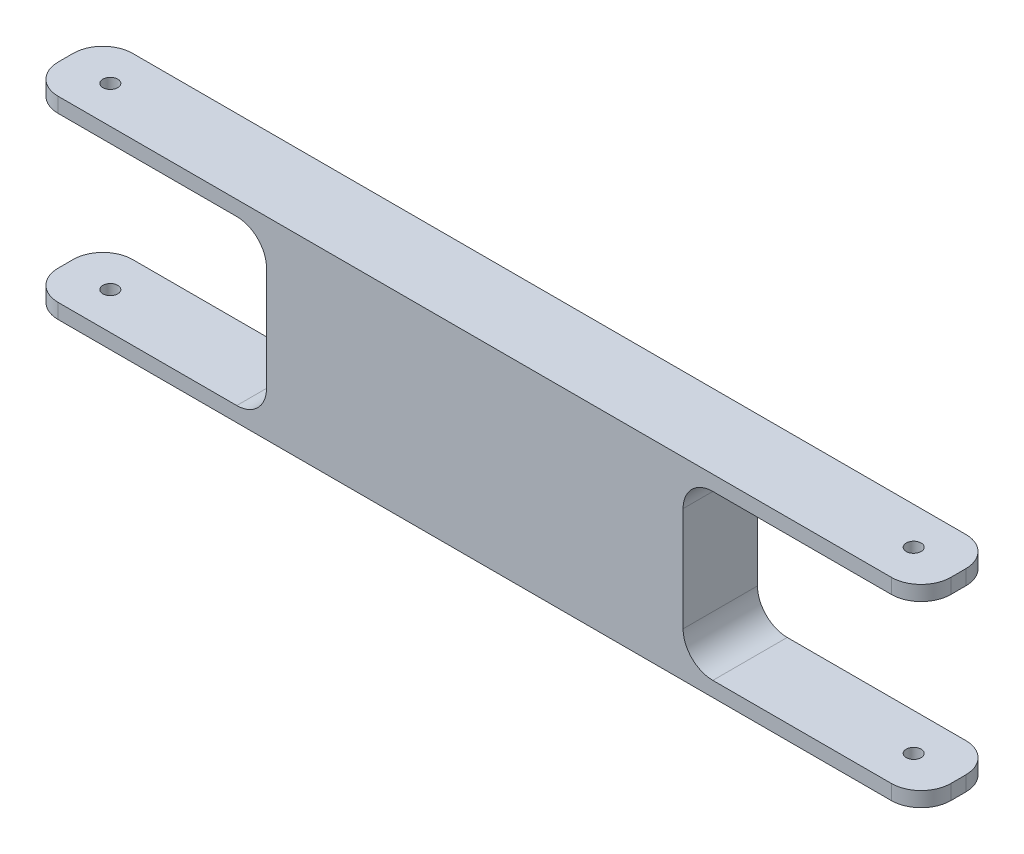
ISO-10303-21;
HEADER;
FILE_DESCRIPTION(('STEP AP214'),'2;1');
FILE_NAME('part.step','',(''),(''),'','','');
FILE_SCHEMA(('AUTOMOTIVE_DESIGN { 1 0 10303 214 1 1 1 1 }'));
ENDSEC;
DATA;
#1=APPLICATION_CONTEXT('core data for automotive mechanical design processes');
#2=APPLICATION_PROTOCOL_DEFINITION('international standard','automotive_design',2000,#1);
#3=PRODUCT_CONTEXT('',#1,'mechanical');
#4=PRODUCT('Part','Part','',(#3));
#5=PRODUCT_RELATED_PRODUCT_CATEGORY('part','',(#4));
#6=PRODUCT_DEFINITION_FORMATION('','',#4);
#7=PRODUCT_DEFINITION_CONTEXT('part definition',#1,'design');
#8=PRODUCT_DEFINITION('design','',#6,#7);
#9=PRODUCT_DEFINITION_SHAPE('','',#8);
#10=(LENGTH_UNIT() NAMED_UNIT(*) SI_UNIT(.MILLI.,.METRE.));
#11=(NAMED_UNIT(*) PLANE_ANGLE_UNIT() SI_UNIT($,.RADIAN.));
#12=(NAMED_UNIT(*) SI_UNIT($,.STERADIAN.) SOLID_ANGLE_UNIT());
#13=UNCERTAINTY_MEASURE_WITH_UNIT(LENGTH_MEASURE(1.E-05),#10,'distance_accuracy_value','');
#14=(GEOMETRIC_REPRESENTATION_CONTEXT(3) GLOBAL_UNCERTAINTY_ASSIGNED_CONTEXT((#13)) GLOBAL_UNIT_ASSIGNED_CONTEXT((#10,
#11,#12)) REPRESENTATION_CONTEXT('',''));
#15=CARTESIAN_POINT('',(0.,0.,0.));
#16=DIRECTION('',(0.,0.,1.));
#17=DIRECTION('',(1.,0.,0.));
#18=AXIS2_PLACEMENT_3D('',#15,#16,#17);
#19=CARTESIAN_POINT('',(-150.,-32.5,25.));
#20=DIRECTION('',(1.,0.,0.));
#21=DIRECTION('',(0.,0.,-1.));
#22=AXIS2_PLACEMENT_3D('',#19,#20,#21);
#23=PLANE('',#22);
#24=DIRECTION('',(0.,0.,1.));
#25=VECTOR('',#24,1.);
#26=CARTESIAN_POINT('',(-150.,27.5,-5.));
#27=LINE('',#26,#25);
#28=CARTESIAN_POINT('',(-150.,27.5,10.));
#29=VERTEX_POINT('',#28);
#30=CARTESIAN_POINT('',(-150.,27.5,15.));
#31=VERTEX_POINT('',#30);
#32=EDGE_CURVE('E249',#29,#31,#27,.T.);
#33=ORIENTED_EDGE('',*,*,#32,.T.);
#34=DIRECTION('',(0.,-1.,0.));
#35=VECTOR('',#34,1.);
#36=CARTESIAN_POINT('',(-150.,32.5,15.));
#37=LINE('',#36,#35);
#38=CARTESIAN_POINT('',(-150.,32.5,15.));
#39=VERTEX_POINT('',#38);
#40=EDGE_CURVE('E386',#31,#39,#37,.F.);
#41=ORIENTED_EDGE('',*,*,#40,.T.);
#42=DIRECTION('',(0.,0.,-1.));
#43=VECTOR('',#42,1.);
#44=CARTESIAN_POINT('',(-150.,32.5,25.));
#45=LINE('',#44,#43);
#46=CARTESIAN_POINT('',(-150.,32.5,10.));
#47=VERTEX_POINT('',#46);
#48=EDGE_CURVE('E266',#39,#47,#45,.T.);
#49=ORIENTED_EDGE('',*,*,#48,.T.);
#50=DIRECTION('',(0.,-1.,0.));
#51=VECTOR('',#50,1.);
#52=CARTESIAN_POINT('',(-150.,-32.5,10.));
#53=LINE('',#52,#51);
#54=EDGE_CURVE('E383',#47,#29,#53,.T.);
#55=ORIENTED_EDGE('',*,*,#54,.T.);
#56=EDGE_LOOP('',(#33,#41,#49,#55));
#57=FACE_BOUND('',#56,.T.);
#58=ADVANCED_FACE('F41',(#57),#23,.F.);
#59=CARTESIAN_POINT('',(150.,-32.5,25.));
#60=DIRECTION('',(-1.,0.,0.));
#61=DIRECTION('',(0.,0.,1.));
#62=AXIS2_PLACEMENT_3D('',#59,#60,#61);
#63=PLANE('',#62);
#64=DIRECTION('',(0.,0.,-1.));
#65=VECTOR('',#64,1.);
#66=CARTESIAN_POINT('',(150.,-32.5,25.));
#67=LINE('',#66,#65);
#68=CARTESIAN_POINT('',(150.,-32.5,15.));
#69=VERTEX_POINT('',#68);
#70=CARTESIAN_POINT('',(150.,-32.5,10.));
#71=VERTEX_POINT('',#70);
#72=EDGE_CURVE('E276',#69,#71,#67,.T.);
#73=ORIENTED_EDGE('',*,*,#72,.T.);
#74=DIRECTION('',(0.,1.,0.));
#75=VECTOR('',#74,1.);
#76=CARTESIAN_POINT('',(150.,-32.5,10.));
#77=LINE('',#76,#75);
#78=CARTESIAN_POINT('',(150.,-27.5,10.));
#79=VERTEX_POINT('',#78);
#80=EDGE_CURVE('E364',#71,#79,#77,.T.);
#81=ORIENTED_EDGE('',*,*,#80,.T.);
#82=DIRECTION('',(0.,0.,1.));
#83=VECTOR('',#82,1.);
#84=CARTESIAN_POINT('',(150.,-27.5,-5.));
#85=LINE('',#84,#83);
#86=CARTESIAN_POINT('',(150.,-27.5,15.));
#87=VERTEX_POINT('',#86);
#88=EDGE_CURVE('E237',#79,#87,#85,.T.);
#89=ORIENTED_EDGE('',*,*,#88,.T.);
#90=DIRECTION('',(0.,1.,0.));
#91=VECTOR('',#90,1.);
#92=CARTESIAN_POINT('',(150.,-32.5,15.));
#93=LINE('',#92,#91);
#94=EDGE_CURVE('E362',#87,#69,#93,.F.);
#95=ORIENTED_EDGE('',*,*,#94,.T.);
#96=EDGE_LOOP('',(#73,#81,#89,#95));
#97=FACE_BOUND('',#96,.T.);
#98=ADVANCED_FACE('F444',(#97),#63,.F.);
#99=DIRECTION('',(0.,0.,1.));
#100=VECTOR('',#99,1.);
#101=CARTESIAN_POINT('',(-150.,-27.5,-5.));
#102=LINE('',#101,#100);
#103=CARTESIAN_POINT('',(-150.,-27.5,10.));
#104=VERTEX_POINT('',#103);
#105=CARTESIAN_POINT('',(-150.,-27.5,15.));
#106=VERTEX_POINT('',#105);
#107=EDGE_CURVE('E246',#104,#106,#102,.T.);
#108=ORIENTED_EDGE('',*,*,#107,.F.);
#109=DIRECTION('',(0.,-1.,0.));
#110=VECTOR('',#109,1.);
#111=CARTESIAN_POINT('',(-150.,-32.5,10.));
#112=LINE('',#111,#110);
#113=CARTESIAN_POINT('',(-150.,-32.5,10.));
#114=VERTEX_POINT('',#113);
#115=EDGE_CURVE('E389',#104,#114,#112,.T.);
#116=ORIENTED_EDGE('',*,*,#115,.T.);
#117=DIRECTION('',(0.,0.,-1.));
#118=VECTOR('',#117,1.);
#119=CARTESIAN_POINT('',(-150.,-32.5,25.));
#120=LINE('',#119,#118);
#121=CARTESIAN_POINT('',(-150.,-32.5,15.));
#122=VERTEX_POINT('',#121);
#123=EDGE_CURVE('E279',#122,#114,#120,.T.);
#124=ORIENTED_EDGE('',*,*,#123,.F.);
#125=DIRECTION('',(0.,-1.,0.));
#126=VECTOR('',#125,1.);
#127=CARTESIAN_POINT('',(-150.,-27.5,15.));
#128=LINE('',#127,#126);
#129=EDGE_CURVE('E58',#122,#106,#128,.F.);
#130=ORIENTED_EDGE('',*,*,#129,.T.);
#131=EDGE_LOOP('',(#108,#116,#124,#130));
#132=FACE_BOUND('',#131,.T.);
#133=ADVANCED_FACE('F447',(#132),#23,.F.);
#134=CARTESIAN_POINT('',(150.,-32.5,25.));
#135=DIRECTION('',(0.,1.,0.));
#136=DIRECTION('',(-1.,0.,0.));
#137=AXIS2_PLACEMENT_3D('',#134,#135,#136);
#138=PLANE('',#137);
#139=CARTESIAN_POINT('',(135.,-32.5,12.5));
#140=DIRECTION('',(0.,-1.,0.));
#141=DIRECTION('',(1.,0.,0.));
#142=AXIS2_PLACEMENT_3D('',#139,#140,#141);
#143=CIRCLE('',#142,2.5);
#144=CARTESIAN_POINT('',(137.5,-32.5,12.5));
#145=VERTEX_POINT('',#144);
#146=EDGE_CURVE('E401',#145,#145,#143,.T.);
#147=ORIENTED_EDGE('',*,*,#146,.F.);
#148=EDGE_LOOP('',(#147));
#149=FACE_BOUND('',#148,.T.);
#150=CARTESIAN_POINT('',(-135.,-32.5,12.5));
#151=DIRECTION('',(0.,-1.,0.));
#152=DIRECTION('',(-1.,0.,0.));
#153=AXIS2_PLACEMENT_3D('',#150,#151,#152);
#154=CIRCLE('',#153,2.5);
#155=CARTESIAN_POINT('',(-137.5,-32.5,12.5));
#156=VERTEX_POINT('',#155);
#157=EDGE_CURVE('E406',#156,#156,#154,.T.);
#158=ORIENTED_EDGE('',*,*,#157,.F.);
#159=EDGE_LOOP('',(#158));
#160=FACE_BOUND('',#159,.T.);
#161=DIRECTION('',(1.,0.,0.));
#162=VECTOR('',#161,1.);
#163=CARTESIAN_POINT('',(150.,-32.5,0.));
#164=LINE('',#163,#162);
#165=CARTESIAN_POINT('',(-140.,-32.5,0.));
#166=VERTEX_POINT('',#165);
#167=CARTESIAN_POINT('',(140.,-32.5,0.));
#168=VERTEX_POINT('',#167);
#169=EDGE_CURVE('E244',#166,#168,#164,.T.);
#170=ORIENTED_EDGE('',*,*,#169,.T.);
#171=CARTESIAN_POINT('',(140.,-32.5,10.));
#172=DIRECTION('',(0.,1.,0.));
#173=DIRECTION('',(-1.,0.,0.));
#174=AXIS2_PLACEMENT_3D('',#171,#172,#173);
#175=CIRCLE('',#174,10.);
#176=EDGE_CURVE('E377',#168,#71,#175,.F.);
#177=ORIENTED_EDGE('',*,*,#176,.T.);
#178=ORIENTED_EDGE('',*,*,#72,.F.);
#179=CARTESIAN_POINT('',(140.,-32.5,15.));
#180=DIRECTION('',(0.,1.,0.));
#181=DIRECTION('',(-1.,0.,0.));
#182=AXIS2_PLACEMENT_3D('',#179,#180,#181);
#183=CIRCLE('',#182,10.);
#184=CARTESIAN_POINT('',(140.,-32.5,25.));
#185=VERTEX_POINT('',#184);
#186=EDGE_CURVE('E375',#69,#185,#183,.F.);
#187=ORIENTED_EDGE('',*,*,#186,.T.);
#188=DIRECTION('',(1.,0.,0.));
#189=VECTOR('',#188,1.);
#190=CARTESIAN_POINT('',(150.,-32.5,25.));
#191=LINE('',#190,#189);
#192=CARTESIAN_POINT('',(-140.,-32.5,25.));
#193=VERTEX_POINT('',#192);
#194=EDGE_CURVE('E260',#193,#185,#191,.T.);
#195=ORIENTED_EDGE('',*,*,#194,.F.);
#196=CARTESIAN_POINT('',(-140.,-32.5,15.));
#197=DIRECTION('',(0.,1.,0.));
#198=DIRECTION('',(-1.,0.,0.));
#199=AXIS2_PLACEMENT_3D('',#196,#197,#198);
#200=CIRCLE('',#199,10.);
#201=EDGE_CURVE('E371',#193,#122,#200,.F.);
#202=ORIENTED_EDGE('',*,*,#201,.T.);
#203=ORIENTED_EDGE('',*,*,#123,.T.);
#204=CARTESIAN_POINT('',(-140.,-32.5,10.));
#205=DIRECTION('',(0.,1.,0.));
#206=DIRECTION('',(-1.,0.,0.));
#207=AXIS2_PLACEMENT_3D('',#204,#205,#206);
#208=CIRCLE('',#207,10.);
#209=EDGE_CURVE('E373',#114,#166,#208,.F.);
#210=ORIENTED_EDGE('',*,*,#209,.T.);
#211=EDGE_LOOP('',(#170,#177,#178,#187,#195,#202,#203,#210));
#212=FACE_BOUND('',#211,.T.);
#213=ADVANCED_FACE('F458',(#149,#160,#212),#138,.F.);
#214=DIRECTION('',(0.,0.,1.));
#215=VECTOR('',#214,1.);
#216=CARTESIAN_POINT('',(150.,27.5,-5.));
#217=LINE('',#216,#215);
#218=CARTESIAN_POINT('',(150.,27.5,10.));
#219=VERTEX_POINT('',#218);
#220=CARTESIAN_POINT('',(150.,27.5,15.));
#221=VERTEX_POINT('',#220);
#222=EDGE_CURVE('E233',#219,#221,#217,.T.);
#223=ORIENTED_EDGE('',*,*,#222,.F.);
#224=DIRECTION('',(0.,1.,0.));
#225=VECTOR('',#224,1.);
#226=CARTESIAN_POINT('',(150.,-32.5,10.));
#227=LINE('',#226,#225);
#228=CARTESIAN_POINT('',(150.,32.5,10.));
#229=VERTEX_POINT('',#228);
#230=EDGE_CURVE('E329',#219,#229,#227,.T.);
#231=ORIENTED_EDGE('',*,*,#230,.T.);
#232=DIRECTION('',(0.,0.,-1.));
#233=VECTOR('',#232,1.);
#234=CARTESIAN_POINT('',(150.,32.5,25.));
#235=LINE('',#234,#233);
#236=CARTESIAN_POINT('',(150.,32.5,15.));
#237=VERTEX_POINT('',#236);
#238=EDGE_CURVE('E273',#237,#229,#235,.T.);
#239=ORIENTED_EDGE('',*,*,#238,.F.);
#240=DIRECTION('',(0.,1.,0.));
#241=VECTOR('',#240,1.);
#242=CARTESIAN_POINT('',(150.,27.5,15.));
#243=LINE('',#242,#241);
#244=EDGE_CURVE('E327',#237,#221,#243,.F.);
#245=ORIENTED_EDGE('',*,*,#244,.T.);
#246=EDGE_LOOP('',(#223,#231,#239,#245));
#247=FACE_BOUND('',#246,.T.);
#248=ADVANCED_FACE('F454',(#247),#63,.F.);
#249=CARTESIAN_POINT('',(150.,32.5,25.));
#250=DIRECTION('',(0.,-1.,0.));
#251=DIRECTION('',(1.,0.,0.));
#252=AXIS2_PLACEMENT_3D('',#249,#250,#251);
#253=PLANE('',#252);
#254=CARTESIAN_POINT('',(135.,32.5,12.5));
#255=DIRECTION('',(0.,-1.,0.));
#256=DIRECTION('',(1.,0.,0.));
#257=AXIS2_PLACEMENT_3D('',#254,#255,#256);
#258=CIRCLE('',#257,2.5);
#259=CARTESIAN_POINT('',(137.5,32.5,12.5));
#260=VERTEX_POINT('',#259);
#261=EDGE_CURVE('E395',#260,#260,#258,.T.);
#262=ORIENTED_EDGE('',*,*,#261,.T.);
#263=EDGE_LOOP('',(#262));
#264=FACE_BOUND('',#263,.T.);
#265=CARTESIAN_POINT('',(-135.,32.5,12.5));
#266=DIRECTION('',(0.,-1.,0.));
#267=DIRECTION('',(-1.,0.,0.));
#268=AXIS2_PLACEMENT_3D('',#265,#266,#267);
#269=CIRCLE('',#268,2.5);
#270=CARTESIAN_POINT('',(-137.5,32.5,12.5));
#271=VERTEX_POINT('',#270);
#272=EDGE_CURVE('E411',#271,#271,#269,.T.);
#273=ORIENTED_EDGE('',*,*,#272,.T.);
#274=EDGE_LOOP('',(#273));
#275=FACE_BOUND('',#274,.T.);
#276=ORIENTED_EDGE('',*,*,#238,.T.);
#277=CARTESIAN_POINT('',(140.,32.5,10.));
#278=DIRECTION('',(0.,-1.,0.));
#279=DIRECTION('',(1.,0.,0.));
#280=AXIS2_PLACEMENT_3D('',#277,#278,#279);
#281=CIRCLE('',#280,10.);
#282=CARTESIAN_POINT('',(140.,32.5,0.));
#283=VERTEX_POINT('',#282);
#284=EDGE_CURVE('E338',#229,#283,#281,.F.);
#285=ORIENTED_EDGE('',*,*,#284,.T.);
#286=DIRECTION('',(-1.,0.,0.));
#287=VECTOR('',#286,1.);
#288=CARTESIAN_POINT('',(150.,32.5,0.));
#289=LINE('',#288,#287);
#290=CARTESIAN_POINT('',(-140.,32.5,0.));
#291=VERTEX_POINT('',#290);
#292=EDGE_CURVE('E263',#283,#291,#289,.T.);
#293=ORIENTED_EDGE('',*,*,#292,.T.);
#294=CARTESIAN_POINT('',(-140.,32.5,10.));
#295=DIRECTION('',(0.,-1.,0.));
#296=DIRECTION('',(1.,0.,0.));
#297=AXIS2_PLACEMENT_3D('',#294,#295,#296);
#298=CIRCLE('',#297,10.);
#299=EDGE_CURVE('E332',#291,#47,#298,.F.);
#300=ORIENTED_EDGE('',*,*,#299,.T.);
#301=ORIENTED_EDGE('',*,*,#48,.F.);
#302=CARTESIAN_POINT('',(-140.,32.5,15.));
#303=DIRECTION('',(0.,-1.,0.));
#304=DIRECTION('',(1.,0.,0.));
#305=AXIS2_PLACEMENT_3D('',#302,#303,#304);
#306=CIRCLE('',#305,10.);
#307=CARTESIAN_POINT('',(-140.,32.5,25.));
#308=VERTEX_POINT('',#307);
#309=EDGE_CURVE('E334',#39,#308,#306,.F.);
#310=ORIENTED_EDGE('',*,*,#309,.T.);
#311=DIRECTION('',(-1.,0.,0.));
#312=VECTOR('',#311,1.);
#313=CARTESIAN_POINT('',(150.,32.5,25.));
#314=LINE('',#313,#312);
#315=CARTESIAN_POINT('',(140.,32.5,25.));
#316=VERTEX_POINT('',#315);
#317=EDGE_CURVE('E262',#316,#308,#314,.T.);
#318=ORIENTED_EDGE('',*,*,#317,.F.);
#319=CARTESIAN_POINT('',(140.,32.5,15.));
#320=DIRECTION('',(0.,-1.,0.));
#321=DIRECTION('',(1.,0.,0.));
#322=AXIS2_PLACEMENT_3D('',#319,#320,#321);
#323=CIRCLE('',#322,10.);
#324=EDGE_CURVE('E336',#316,#237,#323,.F.);
#325=ORIENTED_EDGE('',*,*,#324,.T.);
#326=EDGE_LOOP('',(#276,#285,#293,#300,#301,#310,#318,#325));
#327=FACE_BOUND('',#326,.T.);
#328=ADVANCED_FACE('F513',(#264,#275,#327),#253,.F.);
#329=CARTESIAN_POINT('',(0.,0.,25.));
#330=DIRECTION('',(0.,0.,1.));
#331=DIRECTION('',(1.,0.,0.));
#332=AXIS2_PLACEMENT_3D('',#329,#330,#331);
#333=PLANE('',#332);
#334=DIRECTION('',(-1.,0.,0.));
#335=VECTOR('',#334,1.);
#336=CARTESIAN_POINT('',(150.,27.5,25.));
#337=LINE('',#336,#335);
#338=CARTESIAN_POINT('',(140.,27.5,25.));
#339=VERTEX_POINT('',#338);
#340=CARTESIAN_POINT('',(80.,27.5,25.));
#341=VERTEX_POINT('',#340);
#342=EDGE_CURVE('E239',#339,#341,#337,.T.);
#343=ORIENTED_EDGE('',*,*,#342,.F.);
#344=DIRECTION('',(0.,1.,0.));
#345=VECTOR('',#344,1.);
#346=CARTESIAN_POINT('',(140.,32.5,25.));
#347=LINE('',#346,#345);
#348=EDGE_CURVE('E359',#339,#316,#347,.T.);
#349=ORIENTED_EDGE('',*,*,#348,.T.);
#350=ORIENTED_EDGE('',*,*,#317,.T.);
#351=DIRECTION('',(0.,-1.,0.));
#352=VECTOR('',#351,1.);
#353=CARTESIAN_POINT('',(-140.,27.5,25.));
#354=LINE('',#353,#352);
#355=CARTESIAN_POINT('',(-140.,27.5,25.));
#356=VERTEX_POINT('',#355);
#357=EDGE_CURVE('E355',#308,#356,#354,.T.);
#358=ORIENTED_EDGE('',*,*,#357,.T.);
#359=DIRECTION('',(-1.,0.,0.));
#360=VECTOR('',#359,1.);
#361=CARTESIAN_POINT('',(-150.,27.5,25.));
#362=LINE('',#361,#360);
#363=CARTESIAN_POINT('',(-80.,27.5,25.));
#364=VERTEX_POINT('',#363);
#365=EDGE_CURVE('E248',#364,#356,#362,.T.);
#366=ORIENTED_EDGE('',*,*,#365,.F.);
#367=CARTESIAN_POINT('',(-80.,17.5,25.));
#368=DIRECTION('',(0.,0.,1.));
#369=DIRECTION('',(1.,0.,0.));
#370=AXIS2_PLACEMENT_3D('',#367,#368,#369);
#371=CIRCLE('',#370,10.);
#372=CARTESIAN_POINT('',(-70.,17.5,25.));
#373=VERTEX_POINT('',#372);
#374=EDGE_CURVE('E323',#364,#373,#371,.F.);
#375=ORIENTED_EDGE('',*,*,#374,.T.);
#376=DIRECTION('',(0.,1.,0.));
#377=VECTOR('',#376,1.);
#378=CARTESIAN_POINT('',(-70.,27.5,25.));
#379=LINE('',#378,#377);
#380=CARTESIAN_POINT('',(-70.,-17.5,25.));
#381=VERTEX_POINT('',#380);
#382=EDGE_CURVE('E255',#381,#373,#379,.T.);
#383=ORIENTED_EDGE('',*,*,#382,.F.);
#384=CARTESIAN_POINT('',(-80.,-17.5,25.));
#385=DIRECTION('',(0.,0.,1.));
#386=DIRECTION('',(1.,0.,0.));
#387=AXIS2_PLACEMENT_3D('',#384,#385,#386);
#388=CIRCLE('',#387,10.);
#389=CARTESIAN_POINT('',(-80.,-27.5,25.));
#390=VERTEX_POINT('',#389);
#391=EDGE_CURVE('E313',#381,#390,#388,.F.);
#392=ORIENTED_EDGE('',*,*,#391,.T.);
#393=DIRECTION('',(1.,0.,0.));
#394=VECTOR('',#393,1.);
#395=CARTESIAN_POINT('',(-150.,-27.5,25.));
#396=LINE('',#395,#394);
#397=CARTESIAN_POINT('',(-140.,-27.5,25.));
#398=VERTEX_POINT('',#397);
#399=EDGE_CURVE('E258',#398,#390,#396,.T.);
#400=ORIENTED_EDGE('',*,*,#399,.F.);
#401=DIRECTION('',(0.,-1.,0.));
#402=VECTOR('',#401,1.);
#403=CARTESIAN_POINT('',(-140.,-32.5,25.));
#404=LINE('',#403,#402);
#405=EDGE_CURVE('E352',#398,#193,#404,.T.);
#406=ORIENTED_EDGE('',*,*,#405,.T.);
#407=ORIENTED_EDGE('',*,*,#194,.T.);
#408=DIRECTION('',(0.,1.,0.));
#409=VECTOR('',#408,1.);
#410=CARTESIAN_POINT('',(140.,-27.5,25.));
#411=LINE('',#410,#409);
#412=CARTESIAN_POINT('',(140.,-27.5,25.));
#413=VERTEX_POINT('',#412);
#414=EDGE_CURVE('E232',#185,#413,#411,.T.);
#415=ORIENTED_EDGE('',*,*,#414,.T.);
#416=DIRECTION('',(1.,0.,0.));
#417=VECTOR('',#416,1.);
#418=CARTESIAN_POINT('',(150.,-27.5,25.));
#419=LINE('',#418,#417);
#420=CARTESIAN_POINT('',(80.,-27.5,25.));
#421=VERTEX_POINT('',#420);
#422=EDGE_CURVE('E222',#421,#413,#419,.T.);
#423=ORIENTED_EDGE('',*,*,#422,.F.);
#424=CARTESIAN_POINT('',(80.,-17.5,25.));
#425=DIRECTION('',(0.,0.,1.));
#426=DIRECTION('',(1.,0.,0.));
#427=AXIS2_PLACEMENT_3D('',#424,#425,#426);
#428=CIRCLE('',#427,10.);
#429=CARTESIAN_POINT('',(70.,-17.5,25.));
#430=VERTEX_POINT('',#429);
#431=EDGE_CURVE('E204',#421,#430,#428,.F.);
#432=ORIENTED_EDGE('',*,*,#431,.T.);
#433=DIRECTION('',(0.,-1.,0.));
#434=VECTOR('',#433,1.);
#435=CARTESIAN_POINT('',(70.,27.5,25.));
#436=LINE('',#435,#434);
#437=CARTESIAN_POINT('',(70.,17.5,25.));
#438=VERTEX_POINT('',#437);
#439=EDGE_CURVE('E234',#438,#430,#436,.T.);
#440=ORIENTED_EDGE('',*,*,#439,.F.);
#441=CARTESIAN_POINT('',(80.,17.5,25.));
#442=DIRECTION('',(0.,0.,1.));
#443=DIRECTION('',(1.,0.,0.));
#444=AXIS2_PLACEMENT_3D('',#441,#442,#443);
#445=CIRCLE('',#444,10.);
#446=EDGE_CURVE('E318',#438,#341,#445,.F.);
#447=ORIENTED_EDGE('',*,*,#446,.T.);
#448=EDGE_LOOP('',(#343,#349,#350,#358,#366,#375,#383,#392,#400,#406,#407,#415,#423,#432,#440,#447));
#449=FACE_BOUND('',#448,.T.);
#450=ADVANCED_FACE('F229',(#449),#333,.T.);
#451=CARTESIAN_POINT('',(0.,0.,0.));
#452=DIRECTION('',(0.,0.,1.));
#453=DIRECTION('',(1.,0.,0.));
#454=AXIS2_PLACEMENT_3D('',#451,#452,#453);
#455=PLANE('',#454);
#456=ORIENTED_EDGE('',*,*,#292,.F.);
#457=DIRECTION('',(0.,1.,0.));
#458=VECTOR('',#457,1.);
#459=CARTESIAN_POINT('',(140.,0.,0.));
#460=LINE('',#459,#458);
#461=CARTESIAN_POINT('',(140.,27.5,0.));
#462=VERTEX_POINT('',#461);
#463=EDGE_CURVE('E346',#283,#462,#460,.F.);
#464=ORIENTED_EDGE('',*,*,#463,.T.);
#465=DIRECTION('',(-1.,0.,0.));
#466=VECTOR('',#465,1.);
#467=CARTESIAN_POINT('',(0.,27.5,0.));
#468=LINE('',#467,#466);
#469=CARTESIAN_POINT('',(80.,27.5,0.));
#470=VERTEX_POINT('',#469);
#471=EDGE_CURVE('E290',#462,#470,#468,.T.);
#472=ORIENTED_EDGE('',*,*,#471,.T.);
#473=CARTESIAN_POINT('',(80.,17.5,0.));
#474=DIRECTION('',(0.,0.,1.));
#475=DIRECTION('',(1.,0.,0.));
#476=AXIS2_PLACEMENT_3D('',#473,#474,#475);
#477=CIRCLE('',#476,10.);
#478=CARTESIAN_POINT('',(70.,17.5,0.));
#479=VERTEX_POINT('',#478);
#480=EDGE_CURVE('E321',#470,#479,#477,.T.);
#481=ORIENTED_EDGE('',*,*,#480,.T.);
#482=DIRECTION('',(0.,-1.,0.));
#483=VECTOR('',#482,1.);
#484=CARTESIAN_POINT('',(70.,0.,0.));
#485=LINE('',#484,#483);
#486=CARTESIAN_POINT('',(70.,-17.5,0.));
#487=VERTEX_POINT('',#486);
#488=EDGE_CURVE('E292',#479,#487,#485,.T.);
#489=ORIENTED_EDGE('',*,*,#488,.T.);
#490=CARTESIAN_POINT('',(80.,-17.5,0.));
#491=DIRECTION('',(0.,0.,1.));
#492=DIRECTION('',(1.,0.,0.));
#493=AXIS2_PLACEMENT_3D('',#490,#491,#492);
#494=CIRCLE('',#493,10.);
#495=CARTESIAN_POINT('',(80.,-27.5,0.));
#496=VERTEX_POINT('',#495);
#497=EDGE_CURVE('E214',#487,#496,#494,.T.);
#498=ORIENTED_EDGE('',*,*,#497,.T.);
#499=DIRECTION('',(1.,0.,0.));
#500=VECTOR('',#499,1.);
#501=CARTESIAN_POINT('',(0.,-27.5,0.));
#502=LINE('',#501,#500);
#503=CARTESIAN_POINT('',(140.,-27.5,0.));
#504=VERTEX_POINT('',#503);
#505=EDGE_CURVE('E224',#496,#504,#502,.T.);
#506=ORIENTED_EDGE('',*,*,#505,.T.);
#507=DIRECTION('',(0.,1.,0.));
#508=VECTOR('',#507,1.);
#509=CARTESIAN_POINT('',(140.,0.,0.));
#510=LINE('',#509,#508);
#511=EDGE_CURVE('E344',#504,#168,#510,.F.);
#512=ORIENTED_EDGE('',*,*,#511,.T.);
#513=ORIENTED_EDGE('',*,*,#169,.F.);
#514=DIRECTION('',(0.,-1.,0.));
#515=VECTOR('',#514,1.);
#516=CARTESIAN_POINT('',(-140.,0.,0.));
#517=LINE('',#516,#515);
#518=CARTESIAN_POINT('',(-140.,-27.5,0.));
#519=VERTEX_POINT('',#518);
#520=EDGE_CURVE('E340',#166,#519,#517,.F.);
#521=ORIENTED_EDGE('',*,*,#520,.T.);
#522=DIRECTION('',(1.,0.,0.));
#523=VECTOR('',#522,1.);
#524=CARTESIAN_POINT('',(0.,-27.5,0.));
#525=LINE('',#524,#523);
#526=CARTESIAN_POINT('',(-80.,-27.5,0.));
#527=VERTEX_POINT('',#526);
#528=EDGE_CURVE('E282',#519,#527,#525,.T.);
#529=ORIENTED_EDGE('',*,*,#528,.T.);
#530=CARTESIAN_POINT('',(-80.,-17.5,0.));
#531=DIRECTION('',(0.,0.,1.));
#532=DIRECTION('',(1.,0.,0.));
#533=AXIS2_PLACEMENT_3D('',#530,#531,#532);
#534=CIRCLE('',#533,10.);
#535=CARTESIAN_POINT('',(-70.,-17.5,0.));
#536=VERTEX_POINT('',#535);
#537=EDGE_CURVE('E316',#527,#536,#534,.T.);
#538=ORIENTED_EDGE('',*,*,#537,.T.);
#539=DIRECTION('',(0.,1.,0.));
#540=VECTOR('',#539,1.);
#541=CARTESIAN_POINT('',(-70.,0.,0.));
#542=LINE('',#541,#540);
#543=CARTESIAN_POINT('',(-70.,17.5,0.));
#544=VERTEX_POINT('',#543);
#545=EDGE_CURVE('E284',#536,#544,#542,.T.);
#546=ORIENTED_EDGE('',*,*,#545,.T.);
#547=CARTESIAN_POINT('',(-80.,17.5,0.));
#548=DIRECTION('',(0.,0.,1.));
#549=DIRECTION('',(1.,0.,0.));
#550=AXIS2_PLACEMENT_3D('',#547,#548,#549);
#551=CIRCLE('',#550,10.);
#552=CARTESIAN_POINT('',(-80.,27.5,0.));
#553=VERTEX_POINT('',#552);
#554=EDGE_CURVE('E325',#544,#553,#551,.T.);
#555=ORIENTED_EDGE('',*,*,#554,.T.);
#556=DIRECTION('',(-1.,0.,0.));
#557=VECTOR('',#556,1.);
#558=CARTESIAN_POINT('',(0.,27.5,0.));
#559=LINE('',#558,#557);
#560=CARTESIAN_POINT('',(-140.,27.5,0.));
#561=VERTEX_POINT('',#560);
#562=EDGE_CURVE('E287',#553,#561,#559,.T.);
#563=ORIENTED_EDGE('',*,*,#562,.T.);
#564=DIRECTION('',(0.,-1.,0.));
#565=VECTOR('',#564,1.);
#566=CARTESIAN_POINT('',(-140.,0.,0.));
#567=LINE('',#566,#565);
#568=EDGE_CURVE('E342',#561,#291,#567,.F.);
#569=ORIENTED_EDGE('',*,*,#568,.T.);
#570=EDGE_LOOP('',(#456,#464,#472,#481,#489,#498,#506,#512,#513,#521,#529,#538,#546,#555,#563,#569));
#571=FACE_BOUND('',#570,.T.);
#572=ADVANCED_FACE('F428',(#571),#455,.F.);
#573=CARTESIAN_POINT('',(-150.,27.5,-5.));
#574=DIRECTION('',(0.,1.,0.));
#575=DIRECTION('',(-1.,0.,0.));
#576=AXIS2_PLACEMENT_3D('',#573,#574,#575);
#577=PLANE('',#576);
#578=CARTESIAN_POINT('',(-135.,27.5,12.5));
#579=DIRECTION('',(0.,1.,0.));
#580=DIRECTION('',(-1.,0.,0.));
#581=AXIS2_PLACEMENT_3D('',#578,#579,#580);
#582=CIRCLE('',#581,2.5);
#583=CARTESIAN_POINT('',(-137.5,27.5,12.5));
#584=VERTEX_POINT('',#583);
#585=EDGE_CURVE('E252',#584,#584,#582,.T.);
#586=ORIENTED_EDGE('',*,*,#585,.T.);
#587=EDGE_LOOP('',(#586));
#588=FACE_BOUND('',#587,.T.);
#589=ORIENTED_EDGE('',*,*,#365,.T.);
#590=CARTESIAN_POINT('',(-140.,27.5,15.));
#591=DIRECTION('',(0.,1.,0.));
#592=DIRECTION('',(-1.,0.,0.));
#593=AXIS2_PLACEMENT_3D('',#590,#591,#592);
#594=CIRCLE('',#593,10.);
#595=EDGE_CURVE('E381',#356,#31,#594,.F.);
#596=ORIENTED_EDGE('',*,*,#595,.T.);
#597=ORIENTED_EDGE('',*,*,#32,.F.);
#598=CARTESIAN_POINT('',(-140.,27.5,10.));
#599=DIRECTION('',(0.,1.,0.));
#600=DIRECTION('',(-1.,0.,0.));
#601=AXIS2_PLACEMENT_3D('',#598,#599,#600);
#602=CIRCLE('',#601,10.);
#603=EDGE_CURVE('E379',#29,#561,#602,.F.);
#604=ORIENTED_EDGE('',*,*,#603,.T.);
#605=ORIENTED_EDGE('',*,*,#562,.F.);
#606=DIRECTION('',(0.,0.,1.));
#607=VECTOR('',#606,1.);
#608=CARTESIAN_POINT('',(-80.,27.5,25.));
#609=LINE('',#608,#607);
#610=EDGE_CURVE('E215',#553,#364,#609,.T.);
#611=ORIENTED_EDGE('',*,*,#610,.T.);
#612=EDGE_LOOP('',(#589,#596,#597,#604,#605,#611));
#613=FACE_BOUND('',#612,.T.);
#614=ADVANCED_FACE('F502',(#588,#613),#577,.F.);
#615=CARTESIAN_POINT('',(-70.,27.5,-5.));
#616=DIRECTION('',(1.,0.,0.));
#617=DIRECTION('',(0.,1.,0.));
#618=AXIS2_PLACEMENT_3D('',#615,#616,#617);
#619=PLANE('',#618);
#620=ORIENTED_EDGE('',*,*,#545,.F.);
#621=DIRECTION('',(0.,0.,1.));
#622=VECTOR('',#621,1.);
#623=CARTESIAN_POINT('',(-70.,-17.5,25.));
#624=LINE('',#623,#622);
#625=EDGE_CURVE('E301',#536,#381,#624,.T.);
#626=ORIENTED_EDGE('',*,*,#625,.T.);
#627=ORIENTED_EDGE('',*,*,#382,.T.);
#628=DIRECTION('',(0.,0.,1.));
#629=VECTOR('',#628,1.);
#630=CARTESIAN_POINT('',(-70.,17.5,0.));
#631=LINE('',#630,#629);
#632=EDGE_CURVE('E299',#373,#544,#631,.F.);
#633=ORIENTED_EDGE('',*,*,#632,.T.);
#634=EDGE_LOOP('',(#620,#626,#627,#633));
#635=FACE_BOUND('',#634,.T.);
#636=ADVANCED_FACE('F494',(#635),#619,.F.);
#637=CARTESIAN_POINT('',(-150.,-27.5,-5.));
#638=DIRECTION('',(0.,-1.,0.));
#639=DIRECTION('',(1.,0.,0.));
#640=AXIS2_PLACEMENT_3D('',#637,#638,#639);
#641=PLANE('',#640);
#642=CARTESIAN_POINT('',(-135.,-27.5,12.5));
#643=DIRECTION('',(0.,-1.,0.));
#644=DIRECTION('',(1.,0.,0.));
#645=AXIS2_PLACEMENT_3D('',#642,#643,#644);
#646=CIRCLE('',#645,2.5);
#647=CARTESIAN_POINT('',(-132.5,-27.5,12.5));
#648=VERTEX_POINT('',#647);
#649=EDGE_CURVE('E45',#648,#648,#646,.T.);
#650=ORIENTED_EDGE('',*,*,#649,.T.);
#651=EDGE_LOOP('',(#650));
#652=FACE_BOUND('',#651,.T.);
#653=ORIENTED_EDGE('',*,*,#528,.F.);
#654=CARTESIAN_POINT('',(-140.,-27.5,10.));
#655=DIRECTION('',(0.,-1.,0.));
#656=DIRECTION('',(1.,0.,0.));
#657=AXIS2_PLACEMENT_3D('',#654,#655,#656);
#658=CIRCLE('',#657,10.);
#659=EDGE_CURVE('E11',#519,#104,#658,.F.);
#660=ORIENTED_EDGE('',*,*,#659,.T.);
#661=ORIENTED_EDGE('',*,*,#107,.T.);
#662=CARTESIAN_POINT('',(-140.,-27.5,15.));
#663=DIRECTION('',(0.,-1.,0.));
#664=DIRECTION('',(1.,0.,0.));
#665=AXIS2_PLACEMENT_3D('',#662,#663,#664);
#666=CIRCLE('',#665,10.);
#667=EDGE_CURVE('E50',#106,#398,#666,.F.);
#668=ORIENTED_EDGE('',*,*,#667,.T.);
#669=ORIENTED_EDGE('',*,*,#399,.T.);
#670=DIRECTION('',(0.,0.,1.));
#671=VECTOR('',#670,1.);
#672=CARTESIAN_POINT('',(-80.,-27.5,0.));
#673=LINE('',#672,#671);
#674=EDGE_CURVE('E304',#390,#527,#673,.F.);
#675=ORIENTED_EDGE('',*,*,#674,.T.);
#676=EDGE_LOOP('',(#653,#660,#661,#668,#669,#675));
#677=FACE_BOUND('',#676,.T.);
#678=ADVANCED_FACE('F440',(#652,#677),#641,.F.);
#679=CARTESIAN_POINT('',(150.,-27.5,-5.));
#680=DIRECTION('',(0.,-1.,0.));
#681=DIRECTION('',(1.,0.,0.));
#682=AXIS2_PLACEMENT_3D('',#679,#680,#681);
#683=PLANE('',#682);
#684=CARTESIAN_POINT('',(135.,-27.5,12.5));
#685=DIRECTION('',(0.,-1.,0.));
#686=DIRECTION('',(1.,0.,0.));
#687=AXIS2_PLACEMENT_3D('',#684,#685,#686);
#688=CIRCLE('',#687,2.5);
#689=CARTESIAN_POINT('',(137.5,-27.5,12.5));
#690=VERTEX_POINT('',#689);
#691=EDGE_CURVE('E394',#690,#690,#688,.T.);
#692=ORIENTED_EDGE('',*,*,#691,.T.);
#693=EDGE_LOOP('',(#692));
#694=FACE_BOUND('',#693,.T.);
#695=ORIENTED_EDGE('',*,*,#88,.F.);
#696=CARTESIAN_POINT('',(140.,-27.5,10.));
#697=DIRECTION('',(0.,-1.,0.));
#698=DIRECTION('',(1.,0.,0.));
#699=AXIS2_PLACEMENT_3D('',#696,#697,#698);
#700=CIRCLE('',#699,10.);
#701=EDGE_CURVE('E369',#79,#504,#700,.F.);
#702=ORIENTED_EDGE('',*,*,#701,.T.);
#703=ORIENTED_EDGE('',*,*,#505,.F.);
#704=DIRECTION('',(0.,0.,1.));
#705=VECTOR('',#704,1.);
#706=CARTESIAN_POINT('',(80.,-27.5,25.));
#707=LINE('',#706,#705);
#708=EDGE_CURVE('E208',#496,#421,#707,.T.);
#709=ORIENTED_EDGE('',*,*,#708,.T.);
#710=ORIENTED_EDGE('',*,*,#422,.T.);
#711=CARTESIAN_POINT('',(140.,-27.5,15.));
#712=DIRECTION('',(0.,-1.,0.));
#713=DIRECTION('',(1.,0.,0.));
#714=AXIS2_PLACEMENT_3D('',#711,#712,#713);
#715=CIRCLE('',#714,10.);
#716=EDGE_CURVE('E367',#413,#87,#715,.F.);
#717=ORIENTED_EDGE('',*,*,#716,.T.);
#718=EDGE_LOOP('',(#695,#702,#703,#709,#710,#717));
#719=FACE_BOUND('',#718,.T.);
#720=ADVANCED_FACE('F221',(#694,#719),#683,.F.);
#721=CARTESIAN_POINT('',(70.,27.5,-5.));
#722=DIRECTION('',(-1.,0.,0.));
#723=DIRECTION('',(0.,0.,1.));
#724=AXIS2_PLACEMENT_3D('',#721,#722,#723);
#725=PLANE('',#724);
#726=ORIENTED_EDGE('',*,*,#439,.T.);
#727=DIRECTION('',(0.,0.,1.));
#728=VECTOR('',#727,1.);
#729=CARTESIAN_POINT('',(70.,-17.5,0.));
#730=LINE('',#729,#728);
#731=EDGE_CURVE('E209',#430,#487,#730,.F.);
#732=ORIENTED_EDGE('',*,*,#731,.T.);
#733=ORIENTED_EDGE('',*,*,#488,.F.);
#734=DIRECTION('',(0.,0.,1.));
#735=VECTOR('',#734,1.);
#736=CARTESIAN_POINT('',(70.,17.5,25.));
#737=LINE('',#736,#735);
#738=EDGE_CURVE('E225',#479,#438,#737,.T.);
#739=ORIENTED_EDGE('',*,*,#738,.T.);
#740=EDGE_LOOP('',(#726,#732,#733,#739));
#741=FACE_BOUND('',#740,.T.);
#742=ADVANCED_FACE('F430',(#741),#725,.F.);
#743=CARTESIAN_POINT('',(150.,27.5,-5.));
#744=DIRECTION('',(0.,1.,0.));
#745=DIRECTION('',(-1.,0.,0.));
#746=AXIS2_PLACEMENT_3D('',#743,#744,#745);
#747=PLANE('',#746);
#748=CARTESIAN_POINT('',(135.,27.5,12.5));
#749=DIRECTION('',(0.,1.,0.));
#750=DIRECTION('',(-1.,0.,0.));
#751=AXIS2_PLACEMENT_3D('',#748,#749,#750);
#752=CIRCLE('',#751,2.5);
#753=CARTESIAN_POINT('',(132.5,27.5,12.5));
#754=VERTEX_POINT('',#753);
#755=EDGE_CURVE('E392',#754,#754,#752,.T.);
#756=ORIENTED_EDGE('',*,*,#755,.T.);
#757=EDGE_LOOP('',(#756));
#758=FACE_BOUND('',#757,.T.);
#759=ORIENTED_EDGE('',*,*,#471,.F.);
#760=CARTESIAN_POINT('',(140.,27.5,10.));
#761=DIRECTION('',(0.,1.,0.));
#762=DIRECTION('',(-1.,0.,0.));
#763=AXIS2_PLACEMENT_3D('',#760,#761,#762);
#764=CIRCLE('',#763,10.);
#765=EDGE_CURVE('E350',#462,#219,#764,.F.);
#766=ORIENTED_EDGE('',*,*,#765,.T.);
#767=ORIENTED_EDGE('',*,*,#222,.T.);
#768=CARTESIAN_POINT('',(140.,27.5,15.));
#769=DIRECTION('',(0.,1.,0.));
#770=DIRECTION('',(-1.,0.,0.));
#771=AXIS2_PLACEMENT_3D('',#768,#769,#770);
#772=CIRCLE('',#771,10.);
#773=EDGE_CURVE('E348',#221,#339,#772,.F.);
#774=ORIENTED_EDGE('',*,*,#773,.T.);
#775=ORIENTED_EDGE('',*,*,#342,.T.);
#776=DIRECTION('',(0.,0.,1.));
#777=VECTOR('',#776,1.);
#778=CARTESIAN_POINT('',(80.,27.5,0.));
#779=LINE('',#778,#777);
#780=EDGE_CURVE('E307',#341,#470,#779,.F.);
#781=ORIENTED_EDGE('',*,*,#780,.T.);
#782=EDGE_LOOP('',(#759,#766,#767,#774,#775,#781));
#783=FACE_BOUND('',#782,.T.);
#784=ADVANCED_FACE('F417',(#758,#783),#747,.F.);
#785=CARTESIAN_POINT('',(80.,-17.5,-5.));
#786=DIRECTION('',(0.,0.,-1.));
#787=DIRECTION('',(-1.,0.,0.));
#788=AXIS2_PLACEMENT_3D('',#785,#786,#787);
#789=CYLINDRICAL_SURFACE('',#788,10.);
#790=ORIENTED_EDGE('',*,*,#497,.F.);
#791=ORIENTED_EDGE('',*,*,#731,.F.);
#792=ORIENTED_EDGE('',*,*,#431,.F.);
#793=ORIENTED_EDGE('',*,*,#708,.F.);
#794=EDGE_LOOP('',(#790,#791,#792,#793));
#795=FACE_BOUND('',#794,.T.);
#796=ADVANCED_FACE('F207',(#795),#789,.F.);
#797=CARTESIAN_POINT('',(-80.,-17.5,-5.));
#798=DIRECTION('',(0.,0.,-1.));
#799=DIRECTION('',(-1.,0.,0.));
#800=AXIS2_PLACEMENT_3D('',#797,#798,#799);
#801=CYLINDRICAL_SURFACE('',#800,10.);
#802=ORIENTED_EDGE('',*,*,#537,.F.);
#803=ORIENTED_EDGE('',*,*,#674,.F.);
#804=ORIENTED_EDGE('',*,*,#391,.F.);
#805=ORIENTED_EDGE('',*,*,#625,.F.);
#806=EDGE_LOOP('',(#802,#803,#804,#805));
#807=FACE_BOUND('',#806,.T.);
#808=ADVANCED_FACE('F490',(#807),#801,.F.);
#809=CARTESIAN_POINT('',(80.,17.5,-5.));
#810=DIRECTION('',(0.,0.,-1.));
#811=DIRECTION('',(-1.,0.,0.));
#812=AXIS2_PLACEMENT_3D('',#809,#810,#811);
#813=CYLINDRICAL_SURFACE('',#812,10.);
#814=ORIENTED_EDGE('',*,*,#480,.F.);
#815=ORIENTED_EDGE('',*,*,#780,.F.);
#816=ORIENTED_EDGE('',*,*,#446,.F.);
#817=ORIENTED_EDGE('',*,*,#738,.F.);
#818=EDGE_LOOP('',(#814,#815,#816,#817));
#819=FACE_BOUND('',#818,.T.);
#820=ADVANCED_FACE('F424',(#819),#813,.F.);
#821=CARTESIAN_POINT('',(-80.,17.5,-5.));
#822=DIRECTION('',(0.,0.,-1.));
#823=DIRECTION('',(-1.,0.,0.));
#824=AXIS2_PLACEMENT_3D('',#821,#822,#823);
#825=CYLINDRICAL_SURFACE('',#824,10.);
#826=ORIENTED_EDGE('',*,*,#554,.F.);
#827=ORIENTED_EDGE('',*,*,#632,.F.);
#828=ORIENTED_EDGE('',*,*,#374,.F.);
#829=ORIENTED_EDGE('',*,*,#610,.F.);
#830=EDGE_LOOP('',(#826,#827,#828,#829));
#831=FACE_BOUND('',#830,.T.);
#832=ADVANCED_FACE('F497',(#831),#825,.F.);
#833=CARTESIAN_POINT('',(140.,-32.5,10.));
#834=DIRECTION('',(0.,1.,0.));
#835=DIRECTION('',(0.,0.,1.));
#836=AXIS2_PLACEMENT_3D('',#833,#834,#835);
#837=CYLINDRICAL_SURFACE('',#836,10.);
#838=ORIENTED_EDGE('',*,*,#765,.F.);
#839=ORIENTED_EDGE('',*,*,#463,.F.);
#840=ORIENTED_EDGE('',*,*,#284,.F.);
#841=ORIENTED_EDGE('',*,*,#230,.F.);
#842=EDGE_LOOP('',(#838,#839,#840,#841));
#843=FACE_BOUND('',#842,.T.);
#844=ADVANCED_FACE('F526',(#843),#837,.T.);
#845=CARTESIAN_POINT('',(140.,0.,15.));
#846=DIRECTION('',(0.,-1.,0.));
#847=DIRECTION('',(0.,0.,-1.));
#848=AXIS2_PLACEMENT_3D('',#845,#846,#847);
#849=CYLINDRICAL_SURFACE('',#848,10.);
#850=ORIENTED_EDGE('',*,*,#773,.F.);
#851=ORIENTED_EDGE('',*,*,#244,.F.);
#852=ORIENTED_EDGE('',*,*,#324,.F.);
#853=ORIENTED_EDGE('',*,*,#348,.F.);
#854=EDGE_LOOP('',(#850,#851,#852,#853));
#855=FACE_BOUND('',#854,.T.);
#856=ADVANCED_FACE('F524',(#855),#849,.T.);
#857=CARTESIAN_POINT('',(140.,-32.5,10.));
#858=DIRECTION('',(0.,1.,0.));
#859=DIRECTION('',(0.,0.,1.));
#860=AXIS2_PLACEMENT_3D('',#857,#858,#859);
#861=CYLINDRICAL_SURFACE('',#860,10.);
#862=ORIENTED_EDGE('',*,*,#176,.F.);
#863=ORIENTED_EDGE('',*,*,#511,.F.);
#864=ORIENTED_EDGE('',*,*,#701,.F.);
#865=ORIENTED_EDGE('',*,*,#80,.F.);
#866=EDGE_LOOP('',(#862,#863,#864,#865));
#867=FACE_BOUND('',#866,.T.);
#868=ADVANCED_FACE('F474',(#867),#861,.T.);
#869=CARTESIAN_POINT('',(140.,0.,15.));
#870=DIRECTION('',(0.,-1.,0.));
#871=DIRECTION('',(0.,0.,-1.));
#872=AXIS2_PLACEMENT_3D('',#869,#870,#871);
#873=CYLINDRICAL_SURFACE('',#872,10.);
#874=ORIENTED_EDGE('',*,*,#186,.F.);
#875=ORIENTED_EDGE('',*,*,#94,.F.);
#876=ORIENTED_EDGE('',*,*,#716,.F.);
#877=ORIENTED_EDGE('',*,*,#414,.F.);
#878=EDGE_LOOP('',(#874,#875,#876,#877));
#879=FACE_BOUND('',#878,.T.);
#880=ADVANCED_FACE('F480',(#879),#873,.T.);
#881=CARTESIAN_POINT('',(-140.,0.,15.));
#882=DIRECTION('',(0.,1.,0.));
#883=DIRECTION('',(0.,0.,1.));
#884=AXIS2_PLACEMENT_3D('',#881,#882,#883);
#885=CYLINDRICAL_SURFACE('',#884,10.);
#886=ORIENTED_EDGE('',*,*,#309,.F.);
#887=ORIENTED_EDGE('',*,*,#40,.F.);
#888=ORIENTED_EDGE('',*,*,#595,.F.);
#889=ORIENTED_EDGE('',*,*,#357,.F.);
#890=EDGE_LOOP('',(#886,#887,#888,#889));
#891=FACE_BOUND('',#890,.T.);
#892=ADVANCED_FACE('F517',(#891),#885,.T.);
#893=CARTESIAN_POINT('',(-140.,-32.5,10.));
#894=DIRECTION('',(0.,-1.,0.));
#895=DIRECTION('',(0.,0.,-1.));
#896=AXIS2_PLACEMENT_3D('',#893,#894,#895);
#897=CYLINDRICAL_SURFACE('',#896,10.);
#898=ORIENTED_EDGE('',*,*,#299,.F.);
#899=ORIENTED_EDGE('',*,*,#568,.F.);
#900=ORIENTED_EDGE('',*,*,#603,.F.);
#901=ORIENTED_EDGE('',*,*,#54,.F.);
#902=EDGE_LOOP('',(#898,#899,#900,#901));
#903=FACE_BOUND('',#902,.T.);
#904=ADVANCED_FACE('F508',(#903),#897,.T.);
#905=CARTESIAN_POINT('',(-140.,-32.5,10.));
#906=DIRECTION('',(0.,-1.,0.));
#907=DIRECTION('',(0.,0.,-1.));
#908=AXIS2_PLACEMENT_3D('',#905,#906,#907);
#909=CYLINDRICAL_SURFACE('',#908,10.);
#910=ORIENTED_EDGE('',*,*,#659,.F.);
#911=ORIENTED_EDGE('',*,*,#520,.F.);
#912=ORIENTED_EDGE('',*,*,#209,.F.);
#913=ORIENTED_EDGE('',*,*,#115,.F.);
#914=EDGE_LOOP('',(#910,#911,#912,#913));
#915=FACE_BOUND('',#914,.T.);
#916=ADVANCED_FACE('F467',(#915),#909,.T.);
#917=CARTESIAN_POINT('',(-140.,0.,15.));
#918=DIRECTION('',(0.,1.,0.));
#919=DIRECTION('',(0.,0.,1.));
#920=AXIS2_PLACEMENT_3D('',#917,#918,#919);
#921=CYLINDRICAL_SURFACE('',#920,10.);
#922=ORIENTED_EDGE('',*,*,#667,.F.);
#923=ORIENTED_EDGE('',*,*,#129,.F.);
#924=ORIENTED_EDGE('',*,*,#201,.F.);
#925=ORIENTED_EDGE('',*,*,#405,.F.);
#926=EDGE_LOOP('',(#922,#923,#924,#925));
#927=FACE_BOUND('',#926,.T.);
#928=ADVANCED_FACE('F43',(#927),#921,.T.);
#929=CARTESIAN_POINT('',(135.,32.5,12.5));
#930=DIRECTION('',(0.,-1.,0.));
#931=DIRECTION('',(1.,0.,0.));
#932=AXIS2_PLACEMENT_3D('',#929,#930,#931);
#933=CYLINDRICAL_SURFACE('',#932,2.5);
#934=ORIENTED_EDGE('',*,*,#261,.F.);
#935=EDGE_LOOP('',(#934));
#936=FACE_BOUND('',#935,.T.);
#937=ORIENTED_EDGE('',*,*,#755,.F.);
#938=EDGE_LOOP('',(#937));
#939=FACE_BOUND('',#938,.T.);
#940=ADVANCED_FACE('F546',(#936,#939),#933,.F.);
#941=ORIENTED_EDGE('',*,*,#146,.T.);
#942=EDGE_LOOP('',(#941));
#943=FACE_BOUND('',#942,.T.);
#944=ORIENTED_EDGE('',*,*,#691,.F.);
#945=EDGE_LOOP('',(#944));
#946=FACE_BOUND('',#945,.T.);
#947=ADVANCED_FACE('F550',(#943,#946),#933,.F.);
#948=CARTESIAN_POINT('',(-135.,32.5,12.5));
#949=DIRECTION('',(0.,-1.,0.));
#950=DIRECTION('',(1.,0.,0.));
#951=AXIS2_PLACEMENT_3D('',#948,#949,#950);
#952=CYLINDRICAL_SURFACE('',#951,2.5);
#953=ORIENTED_EDGE('',*,*,#157,.T.);
#954=EDGE_LOOP('',(#953));
#955=FACE_BOUND('',#954,.T.);
#956=ORIENTED_EDGE('',*,*,#649,.F.);
#957=EDGE_LOOP('',(#956));
#958=FACE_BOUND('',#957,.T.);
#959=ADVANCED_FACE('F556',(#955,#958),#952,.F.);
#960=ORIENTED_EDGE('',*,*,#272,.F.);
#961=EDGE_LOOP('',(#960));
#962=FACE_BOUND('',#961,.T.);
#963=ORIENTED_EDGE('',*,*,#585,.F.);
#964=EDGE_LOOP('',(#963));
#965=FACE_BOUND('',#964,.T.);
#966=ADVANCED_FACE('F560',(#962,#965),#952,.F.);
#967=CLOSED_SHELL('',(#58,#98,#133,#213,#248,#328,#450,#572,#614,#636,#678,#720,#742,#784,#796,
#808,#820,#832,#844,#856,#868,#880,#892,#904,#916,#928,#940,#947,#959,#966));
#968=MANIFOLD_SOLID_BREP('B2',#967);
#969=ADVANCED_BREP_SHAPE_REPRESENTATION('',(#18,#968),#14);
#970=SHAPE_DEFINITION_REPRESENTATION(#9,#969);
ENDSEC;
END-ISO-10303-21;
